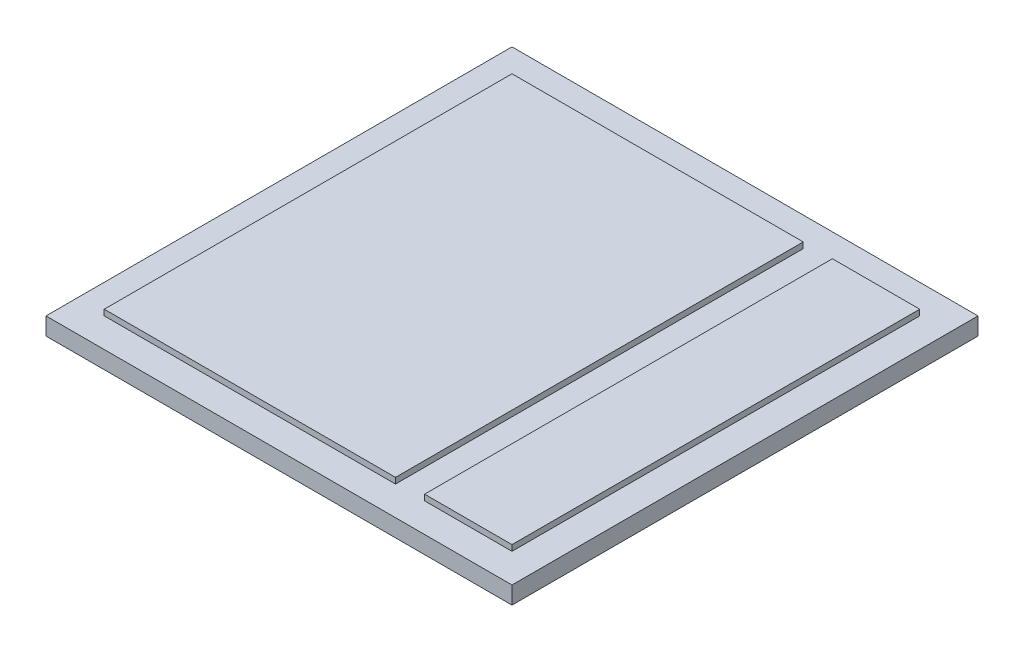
ISO-10303-21;
HEADER;
FILE_DESCRIPTION(('STEP AP214'),'2;1');
FILE_NAME('part.step','',(''),(''),'','','');
FILE_SCHEMA(('AUTOMOTIVE_DESIGN { 1 0 10303 214 1 1 1 1 }'));
ENDSEC;
DATA;
#1=APPLICATION_CONTEXT('core data for automotive mechanical design processes');
#2=APPLICATION_PROTOCOL_DEFINITION('international standard','automotive_design',2000,#1);
#3=PRODUCT_CONTEXT('',#1,'mechanical');
#4=PRODUCT('Part','Part','',(#3));
#5=PRODUCT_RELATED_PRODUCT_CATEGORY('part','',(#4));
#6=PRODUCT_DEFINITION_FORMATION('','',#4);
#7=PRODUCT_DEFINITION_CONTEXT('part definition',#1,'design');
#8=PRODUCT_DEFINITION('design','',#6,#7);
#9=PRODUCT_DEFINITION_SHAPE('','',#8);
#10=(LENGTH_UNIT() NAMED_UNIT(*) SI_UNIT(.MILLI.,.METRE.));
#11=(NAMED_UNIT(*) PLANE_ANGLE_UNIT() SI_UNIT($,.RADIAN.));
#12=(NAMED_UNIT(*) SI_UNIT($,.STERADIAN.) SOLID_ANGLE_UNIT());
#13=UNCERTAINTY_MEASURE_WITH_UNIT(LENGTH_MEASURE(1.E-05),#10,'distance_accuracy_value','');
#14=(GEOMETRIC_REPRESENTATION_CONTEXT(3) GLOBAL_UNCERTAINTY_ASSIGNED_CONTEXT((#13)) GLOBAL_UNIT_ASSIGNED_CONTEXT((#10,
#11,#12)) REPRESENTATION_CONTEXT('',''));
#15=CARTESIAN_POINT('',(0.,0.,0.));
#16=DIRECTION('',(0.,0.,1.));
#17=DIRECTION('',(1.,0.,0.));
#18=AXIS2_PLACEMENT_3D('',#15,#16,#17);
#19=CARTESIAN_POINT('',(0.,3.,0.));
#20=DIRECTION('',(0.,1.,0.));
#21=DIRECTION('',(0.,0.,1.));
#22=AXIS2_PLACEMENT_3D('',#19,#20,#21);
#23=PLANE('',#22);
#24=DIRECTION('',(0.,0.,-1.));
#25=VECTOR('',#24,1.);
#26=CARTESIAN_POINT('',(15.,3.,-35.));
#27=LINE('',#26,#25);
#28=CARTESIAN_POINT('',(15.,3.,35.));
#29=VERTEX_POINT('',#28);
#30=CARTESIAN_POINT('',(15.,3.,-35.));
#31=VERTEX_POINT('',#30);
#32=EDGE_CURVE('E62',#29,#31,#27,.T.);
#33=ORIENTED_EDGE('',*,*,#32,.F.);
#34=DIRECTION('',(1.,0.,0.));
#35=VECTOR('',#34,1.);
#36=CARTESIAN_POINT('',(-35.,3.,35.));
#37=LINE('',#36,#35);
#38=CARTESIAN_POINT('',(-35.,3.,35.));
#39=VERTEX_POINT('',#38);
#40=EDGE_CURVE('E165',#39,#29,#37,.T.);
#41=ORIENTED_EDGE('',*,*,#40,.F.);
#42=DIRECTION('',(0.,0.,1.));
#43=VECTOR('',#42,1.);
#44=CARTESIAN_POINT('',(-35.,3.,-35.));
#45=LINE('',#44,#43);
#46=CARTESIAN_POINT('',(-35.,3.,-35.));
#47=VERTEX_POINT('',#46);
#48=EDGE_CURVE('E174',#47,#39,#45,.T.);
#49=ORIENTED_EDGE('',*,*,#48,.F.);
#50=DIRECTION('',(-1.,0.,0.));
#51=VECTOR('',#50,1.);
#52=CARTESIAN_POINT('',(-35.,3.,-35.));
#53=LINE('',#52,#51);
#54=EDGE_CURVE('E150',#31,#47,#53,.T.);
#55=ORIENTED_EDGE('',*,*,#54,.F.);
#56=EDGE_LOOP('',(#33,#41,#49,#55));
#57=FACE_BOUND('',#56,.T.);
#58=DIRECTION('',(0.,0.,-1.));
#59=VECTOR('',#58,1.);
#60=CARTESIAN_POINT('',(40.,3.,-40.));
#61=LINE('',#60,#59);
#62=CARTESIAN_POINT('',(40.,3.,40.));
#63=VERTEX_POINT('',#62);
#64=CARTESIAN_POINT('',(40.,3.,-40.));
#65=VERTEX_POINT('',#64);
#66=EDGE_CURVE('E190',#63,#65,#61,.T.);
#67=ORIENTED_EDGE('',*,*,#66,.T.);
#68=DIRECTION('',(-1.,0.,0.));
#69=VECTOR('',#68,1.);
#70=CARTESIAN_POINT('',(-40.,3.,-40.));
#71=LINE('',#70,#69);
#72=CARTESIAN_POINT('',(-40.,3.,-40.));
#73=VERTEX_POINT('',#72);
#74=EDGE_CURVE('E193',#65,#73,#71,.T.);
#75=ORIENTED_EDGE('',*,*,#74,.T.);
#76=DIRECTION('',(0.,0.,1.));
#77=VECTOR('',#76,1.);
#78=CARTESIAN_POINT('',(-40.,3.,-40.));
#79=LINE('',#78,#77);
#80=CARTESIAN_POINT('',(-40.,3.,40.));
#81=VERTEX_POINT('',#80);
#82=EDGE_CURVE('E196',#73,#81,#79,.T.);
#83=ORIENTED_EDGE('',*,*,#82,.T.);
#84=DIRECTION('',(1.,0.,0.));
#85=VECTOR('',#84,1.);
#86=CARTESIAN_POINT('',(-40.,3.,40.));
#87=LINE('',#86,#85);
#88=EDGE_CURVE('E198',#81,#63,#87,.T.);
#89=ORIENTED_EDGE('',*,*,#88,.T.);
#90=EDGE_LOOP('',(#67,#75,#83,#89));
#91=FACE_BOUND('',#90,.T.);
#92=DIRECTION('',(-1.,0.,0.));
#93=VECTOR('',#92,1.);
#94=CARTESIAN_POINT('',(20.,3.,-35.));
#95=LINE('',#94,#93);
#96=CARTESIAN_POINT('',(35.,3.,-35.));
#97=VERTEX_POINT('',#96);
#98=CARTESIAN_POINT('',(20.,3.,-35.));
#99=VERTEX_POINT('',#98);
#100=EDGE_CURVE('E148',#97,#99,#95,.T.);
#101=ORIENTED_EDGE('',*,*,#100,.F.);
#102=DIRECTION('',(0.,0.,-1.));
#103=VECTOR('',#102,1.);
#104=CARTESIAN_POINT('',(35.,3.,-35.));
#105=LINE('',#104,#103);
#106=CARTESIAN_POINT('',(35.,3.,35.));
#107=VERTEX_POINT('',#106);
#108=EDGE_CURVE('E143',#107,#97,#105,.T.);
#109=ORIENTED_EDGE('',*,*,#108,.F.);
#110=DIRECTION('',(1.,0.,0.));
#111=VECTOR('',#110,1.);
#112=CARTESIAN_POINT('',(20.,3.,35.));
#113=LINE('',#112,#111);
#114=CARTESIAN_POINT('',(20.,3.,35.));
#115=VERTEX_POINT('',#114);
#116=EDGE_CURVE('E128',#115,#107,#113,.T.);
#117=ORIENTED_EDGE('',*,*,#116,.F.);
#118=DIRECTION('',(0.,0.,1.));
#119=VECTOR('',#118,1.);
#120=CARTESIAN_POINT('',(20.,3.,-35.));
#121=LINE('',#120,#119);
#122=EDGE_CURVE('E136',#99,#115,#121,.T.);
#123=ORIENTED_EDGE('',*,*,#122,.F.);
#124=EDGE_LOOP('',(#101,#109,#117,#123));
#125=FACE_BOUND('',#124,.T.);
#126=ADVANCED_FACE('F39',(#57,#91,#125),#23,.T.);
#127=CARTESIAN_POINT('',(40.,3.,-40.));
#128=DIRECTION('',(-1.,0.,0.));
#129=DIRECTION('',(0.,0.,1.));
#130=AXIS2_PLACEMENT_3D('',#127,#128,#129);
#131=PLANE('',#130);
#132=DIRECTION('',(0.,0.,-1.));
#133=VECTOR('',#132,1.);
#134=CARTESIAN_POINT('',(40.,0.,-40.));
#135=LINE('',#134,#133);
#136=CARTESIAN_POINT('',(40.,0.,40.));
#137=VERTEX_POINT('',#136);
#138=CARTESIAN_POINT('',(40.,0.,-40.));
#139=VERTEX_POINT('',#138);
#140=EDGE_CURVE('E189',#137,#139,#135,.T.);
#141=ORIENTED_EDGE('',*,*,#140,.T.);
#142=DIRECTION('',(0.,-1.,0.));
#143=VECTOR('',#142,1.);
#144=CARTESIAN_POINT('',(40.,3.,-40.));
#145=LINE('',#144,#143);
#146=EDGE_CURVE('E11',#65,#139,#145,.T.);
#147=ORIENTED_EDGE('',*,*,#146,.F.);
#148=ORIENTED_EDGE('',*,*,#66,.F.);
#149=DIRECTION('',(0.,-1.,0.));
#150=VECTOR('',#149,1.);
#151=CARTESIAN_POINT('',(40.,3.,40.));
#152=LINE('',#151,#150);
#153=EDGE_CURVE('E200',#63,#137,#152,.T.);
#154=ORIENTED_EDGE('',*,*,#153,.T.);
#155=EDGE_LOOP('',(#141,#147,#148,#154));
#156=FACE_BOUND('',#155,.T.);
#157=ADVANCED_FACE('F41',(#156),#131,.F.);
#158=CARTESIAN_POINT('',(-40.,3.,-40.));
#159=DIRECTION('',(0.,0.,1.));
#160=DIRECTION('',(1.,0.,0.));
#161=AXIS2_PLACEMENT_3D('',#158,#159,#160);
#162=PLANE('',#161);
#163=DIRECTION('',(-1.,0.,0.));
#164=VECTOR('',#163,1.);
#165=CARTESIAN_POINT('',(-40.,0.,-40.));
#166=LINE('',#165,#164);
#167=CARTESIAN_POINT('',(-40.,0.,-40.));
#168=VERTEX_POINT('',#167);
#169=EDGE_CURVE('E203',#139,#168,#166,.T.);
#170=ORIENTED_EDGE('',*,*,#169,.T.);
#171=DIRECTION('',(0.,-1.,0.));
#172=VECTOR('',#171,1.);
#173=CARTESIAN_POINT('',(-40.,3.,-40.));
#174=LINE('',#173,#172);
#175=EDGE_CURVE('E47',#73,#168,#174,.T.);
#176=ORIENTED_EDGE('',*,*,#175,.F.);
#177=ORIENTED_EDGE('',*,*,#74,.F.);
#178=ORIENTED_EDGE('',*,*,#146,.T.);
#179=EDGE_LOOP('',(#170,#176,#177,#178));
#180=FACE_BOUND('',#179,.T.);
#181=ADVANCED_FACE('F232',(#180),#162,.F.);
#182=CARTESIAN_POINT('',(-40.,3.,-40.));
#183=DIRECTION('',(1.,0.,0.));
#184=DIRECTION('',(0.,0.,-1.));
#185=AXIS2_PLACEMENT_3D('',#182,#183,#184);
#186=PLANE('',#185);
#187=DIRECTION('',(0.,0.,1.));
#188=VECTOR('',#187,1.);
#189=CARTESIAN_POINT('',(-40.,0.,-40.));
#190=LINE('',#189,#188);
#191=CARTESIAN_POINT('',(-40.,0.,40.));
#192=VERTEX_POINT('',#191);
#193=EDGE_CURVE('E205',#168,#192,#190,.T.);
#194=ORIENTED_EDGE('',*,*,#193,.T.);
#195=DIRECTION('',(0.,-1.,0.));
#196=VECTOR('',#195,1.);
#197=CARTESIAN_POINT('',(-40.,3.,40.));
#198=LINE('',#197,#196);
#199=EDGE_CURVE('E210',#81,#192,#198,.T.);
#200=ORIENTED_EDGE('',*,*,#199,.F.);
#201=ORIENTED_EDGE('',*,*,#82,.F.);
#202=ORIENTED_EDGE('',*,*,#175,.T.);
#203=EDGE_LOOP('',(#194,#200,#201,#202));
#204=FACE_BOUND('',#203,.T.);
#205=ADVANCED_FACE('F217',(#204),#186,.F.);
#206=CARTESIAN_POINT('',(-40.,3.,40.));
#207=DIRECTION('',(0.,0.,-1.));
#208=DIRECTION('',(-1.,0.,0.));
#209=AXIS2_PLACEMENT_3D('',#206,#207,#208);
#210=PLANE('',#209);
#211=DIRECTION('',(1.,0.,0.));
#212=VECTOR('',#211,1.);
#213=CARTESIAN_POINT('',(-40.,0.,40.));
#214=LINE('',#213,#212);
#215=EDGE_CURVE('E194',#192,#137,#214,.T.);
#216=ORIENTED_EDGE('',*,*,#215,.T.);
#217=ORIENTED_EDGE('',*,*,#153,.F.);
#218=ORIENTED_EDGE('',*,*,#88,.F.);
#219=ORIENTED_EDGE('',*,*,#199,.T.);
#220=EDGE_LOOP('',(#216,#217,#218,#219));
#221=FACE_BOUND('',#220,.T.);
#222=ADVANCED_FACE('F226',(#221),#210,.F.);
#223=CARTESIAN_POINT('',(0.,0.,0.));
#224=DIRECTION('',(0.,1.,0.));
#225=DIRECTION('',(0.,0.,1.));
#226=AXIS2_PLACEMENT_3D('',#223,#224,#225);
#227=PLANE('',#226);
#228=ORIENTED_EDGE('',*,*,#140,.F.);
#229=ORIENTED_EDGE('',*,*,#215,.F.);
#230=ORIENTED_EDGE('',*,*,#193,.F.);
#231=ORIENTED_EDGE('',*,*,#169,.F.);
#232=EDGE_LOOP('',(#228,#229,#230,#231));
#233=FACE_BOUND('',#232,.T.);
#234=ADVANCED_FACE('F223',(#233),#227,.F.);
#235=CARTESIAN_POINT('',(15.,4.,-35.));
#236=DIRECTION('',(-1.,0.,0.));
#237=DIRECTION('',(0.,0.,1.));
#238=AXIS2_PLACEMENT_3D('',#235,#236,#237);
#239=PLANE('',#238);
#240=ORIENTED_EDGE('',*,*,#32,.T.);
#241=DIRECTION('',(0.,-1.,0.));
#242=VECTOR('',#241,1.);
#243=CARTESIAN_POINT('',(15.,4.,-35.));
#244=LINE('',#243,#242);
#245=CARTESIAN_POINT('',(15.,4.,-35.));
#246=VERTEX_POINT('',#245);
#247=EDGE_CURVE('E186',#246,#31,#244,.T.);
#248=ORIENTED_EDGE('',*,*,#247,.F.);
#249=DIRECTION('',(0.,0.,-1.));
#250=VECTOR('',#249,1.);
#251=CARTESIAN_POINT('',(15.,4.,-35.));
#252=LINE('',#251,#250);
#253=CARTESIAN_POINT('',(15.,4.,35.));
#254=VERTEX_POINT('',#253);
#255=EDGE_CURVE('E161',#254,#246,#252,.T.);
#256=ORIENTED_EDGE('',*,*,#255,.F.);
#257=DIRECTION('',(0.,-1.,0.));
#258=VECTOR('',#257,1.);
#259=CARTESIAN_POINT('',(15.,4.,35.));
#260=LINE('',#259,#258);
#261=EDGE_CURVE('E170',#254,#29,#260,.T.);
#262=ORIENTED_EDGE('',*,*,#261,.T.);
#263=EDGE_LOOP('',(#240,#248,#256,#262));
#264=FACE_BOUND('',#263,.T.);
#265=ADVANCED_FACE('F245',(#264),#239,.F.);
#266=CARTESIAN_POINT('',(-35.,4.,-35.));
#267=DIRECTION('',(0.,0.,1.));
#268=DIRECTION('',(1.,0.,0.));
#269=AXIS2_PLACEMENT_3D('',#266,#267,#268);
#270=PLANE('',#269);
#271=ORIENTED_EDGE('',*,*,#54,.T.);
#272=DIRECTION('',(0.,-1.,0.));
#273=VECTOR('',#272,1.);
#274=CARTESIAN_POINT('',(-35.,4.,-35.));
#275=LINE('',#274,#273);
#276=CARTESIAN_POINT('',(-35.,4.,-35.));
#277=VERTEX_POINT('',#276);
#278=EDGE_CURVE('E183',#277,#47,#275,.T.);
#279=ORIENTED_EDGE('',*,*,#278,.F.);
#280=DIRECTION('',(-1.,0.,0.));
#281=VECTOR('',#280,1.);
#282=CARTESIAN_POINT('',(-35.,4.,-35.));
#283=LINE('',#282,#281);
#284=EDGE_CURVE('E164',#246,#277,#283,.T.);
#285=ORIENTED_EDGE('',*,*,#284,.F.);
#286=ORIENTED_EDGE('',*,*,#247,.T.);
#287=EDGE_LOOP('',(#271,#279,#285,#286));
#288=FACE_BOUND('',#287,.T.);
#289=ADVANCED_FACE('F264',(#288),#270,.F.);
#290=CARTESIAN_POINT('',(-35.,4.,-35.));
#291=DIRECTION('',(1.,0.,0.));
#292=DIRECTION('',(0.,0.,-1.));
#293=AXIS2_PLACEMENT_3D('',#290,#291,#292);
#294=PLANE('',#293);
#295=ORIENTED_EDGE('',*,*,#48,.T.);
#296=DIRECTION('',(0.,-1.,0.));
#297=VECTOR('',#296,1.);
#298=CARTESIAN_POINT('',(-35.,4.,35.));
#299=LINE('',#298,#297);
#300=CARTESIAN_POINT('',(-35.,4.,35.));
#301=VERTEX_POINT('',#300);
#302=EDGE_CURVE('E180',#301,#39,#299,.T.);
#303=ORIENTED_EDGE('',*,*,#302,.F.);
#304=DIRECTION('',(0.,0.,1.));
#305=VECTOR('',#304,1.);
#306=CARTESIAN_POINT('',(-35.,4.,-35.));
#307=LINE('',#306,#305);
#308=EDGE_CURVE('E167',#277,#301,#307,.T.);
#309=ORIENTED_EDGE('',*,*,#308,.F.);
#310=ORIENTED_EDGE('',*,*,#278,.T.);
#311=EDGE_LOOP('',(#295,#303,#309,#310));
#312=FACE_BOUND('',#311,.T.);
#313=ADVANCED_FACE('F271',(#312),#294,.F.);
#314=CARTESIAN_POINT('',(-35.,4.,35.));
#315=DIRECTION('',(0.,0.,-1.));
#316=DIRECTION('',(-1.,0.,0.));
#317=AXIS2_PLACEMENT_3D('',#314,#315,#316);
#318=PLANE('',#317);
#319=ORIENTED_EDGE('',*,*,#40,.T.);
#320=ORIENTED_EDGE('',*,*,#261,.F.);
#321=DIRECTION('',(1.,0.,0.));
#322=VECTOR('',#321,1.);
#323=CARTESIAN_POINT('',(-35.,4.,35.));
#324=LINE('',#323,#322);
#325=EDGE_CURVE('E169',#301,#254,#324,.T.);
#326=ORIENTED_EDGE('',*,*,#325,.F.);
#327=ORIENTED_EDGE('',*,*,#302,.T.);
#328=EDGE_LOOP('',(#319,#320,#326,#327));
#329=FACE_BOUND('',#328,.T.);
#330=ADVANCED_FACE('F278',(#329),#318,.F.);
#331=CARTESIAN_POINT('',(0.,4.,0.));
#332=DIRECTION('',(0.,1.,0.));
#333=DIRECTION('',(0.,0.,1.));
#334=AXIS2_PLACEMENT_3D('',#331,#332,#333);
#335=PLANE('',#334);
#336=ORIENTED_EDGE('',*,*,#255,.T.);
#337=ORIENTED_EDGE('',*,*,#284,.T.);
#338=ORIENTED_EDGE('',*,*,#308,.T.);
#339=ORIENTED_EDGE('',*,*,#325,.T.);
#340=EDGE_LOOP('',(#336,#337,#338,#339));
#341=FACE_BOUND('',#340,.T.);
#342=ADVANCED_FACE('F286',(#341),#335,.T.);
#343=CARTESIAN_POINT('',(35.,4.,-35.));
#344=DIRECTION('',(-1.,0.,0.));
#345=DIRECTION('',(0.,0.,1.));
#346=AXIS2_PLACEMENT_3D('',#343,#344,#345);
#347=PLANE('',#346);
#348=ORIENTED_EDGE('',*,*,#108,.T.);
#349=DIRECTION('',(0.,-1.,0.));
#350=VECTOR('',#349,1.);
#351=CARTESIAN_POINT('',(35.,4.,-35.));
#352=LINE('',#351,#350);
#353=CARTESIAN_POINT('',(35.,4.,-35.));
#354=VERTEX_POINT('',#353);
#355=EDGE_CURVE('E412',#354,#97,#352,.T.);
#356=ORIENTED_EDGE('',*,*,#355,.F.);
#357=DIRECTION('',(0.,0.,-1.));
#358=VECTOR('',#357,1.);
#359=CARTESIAN_POINT('',(35.,4.,-35.));
#360=LINE('',#359,#358);
#361=CARTESIAN_POINT('',(35.,4.,35.));
#362=VERTEX_POINT('',#361);
#363=EDGE_CURVE('E137',#362,#354,#360,.T.);
#364=ORIENTED_EDGE('',*,*,#363,.F.);
#365=DIRECTION('',(0.,-1.,0.));
#366=VECTOR('',#365,1.);
#367=CARTESIAN_POINT('',(35.,4.,35.));
#368=LINE('',#367,#366);
#369=EDGE_CURVE('E131',#362,#107,#368,.T.);
#370=ORIENTED_EDGE('',*,*,#369,.T.);
#371=EDGE_LOOP('',(#348,#356,#364,#370));
#372=FACE_BOUND('',#371,.T.);
#373=ADVANCED_FACE('F141',(#372),#347,.F.);
#374=CARTESIAN_POINT('',(20.,4.,-35.));
#375=DIRECTION('',(0.,0.,1.));
#376=DIRECTION('',(1.,0.,0.));
#377=AXIS2_PLACEMENT_3D('',#374,#375,#376);
#378=PLANE('',#377);
#379=ORIENTED_EDGE('',*,*,#100,.T.);
#380=DIRECTION('',(0.,-1.,0.));
#381=VECTOR('',#380,1.);
#382=CARTESIAN_POINT('',(20.,4.,-35.));
#383=LINE('',#382,#381);
#384=CARTESIAN_POINT('',(20.,4.,-35.));
#385=VERTEX_POINT('',#384);
#386=EDGE_CURVE('E413',#385,#99,#383,.T.);
#387=ORIENTED_EDGE('',*,*,#386,.F.);
#388=DIRECTION('',(-1.,0.,0.));
#389=VECTOR('',#388,1.);
#390=CARTESIAN_POINT('',(20.,4.,-35.));
#391=LINE('',#390,#389);
#392=EDGE_CURVE('E158',#354,#385,#391,.T.);
#393=ORIENTED_EDGE('',*,*,#392,.F.);
#394=ORIENTED_EDGE('',*,*,#355,.T.);
#395=EDGE_LOOP('',(#379,#387,#393,#394));
#396=FACE_BOUND('',#395,.T.);
#397=ADVANCED_FACE('F302',(#396),#378,.F.);
#398=CARTESIAN_POINT('',(20.,4.,-35.));
#399=DIRECTION('',(1.,0.,0.));
#400=DIRECTION('',(0.,0.,-1.));
#401=AXIS2_PLACEMENT_3D('',#398,#399,#400);
#402=PLANE('',#401);
#403=ORIENTED_EDGE('',*,*,#122,.T.);
#404=DIRECTION('',(0.,-1.,0.));
#405=VECTOR('',#404,1.);
#406=CARTESIAN_POINT('',(20.,4.,35.));
#407=LINE('',#406,#405);
#408=CARTESIAN_POINT('',(20.,4.,35.));
#409=VERTEX_POINT('',#408);
#410=EDGE_CURVE('E54',#409,#115,#407,.T.);
#411=ORIENTED_EDGE('',*,*,#410,.F.);
#412=DIRECTION('',(0.,0.,1.));
#413=VECTOR('',#412,1.);
#414=CARTESIAN_POINT('',(20.,4.,-35.));
#415=LINE('',#414,#413);
#416=EDGE_CURVE('E156',#385,#409,#415,.T.);
#417=ORIENTED_EDGE('',*,*,#416,.F.);
#418=ORIENTED_EDGE('',*,*,#386,.T.);
#419=EDGE_LOOP('',(#403,#411,#417,#418));
#420=FACE_BOUND('',#419,.T.);
#421=ADVANCED_FACE('F309',(#420),#402,.F.);
#422=CARTESIAN_POINT('',(20.,4.,35.));
#423=DIRECTION('',(0.,0.,-1.));
#424=DIRECTION('',(-1.,0.,0.));
#425=AXIS2_PLACEMENT_3D('',#422,#423,#424);
#426=PLANE('',#425);
#427=ORIENTED_EDGE('',*,*,#116,.T.);
#428=ORIENTED_EDGE('',*,*,#369,.F.);
#429=DIRECTION('',(1.,0.,0.));
#430=VECTOR('',#429,1.);
#431=CARTESIAN_POINT('',(20.,4.,35.));
#432=LINE('',#431,#430);
#433=EDGE_CURVE('E146',#409,#362,#432,.T.);
#434=ORIENTED_EDGE('',*,*,#433,.F.);
#435=ORIENTED_EDGE('',*,*,#410,.T.);
#436=EDGE_LOOP('',(#427,#428,#434,#435));
#437=FACE_BOUND('',#436,.T.);
#438=ADVANCED_FACE('F130',(#437),#426,.F.);
#439=CARTESIAN_POINT('',(0.,4.,0.));
#440=DIRECTION('',(0.,1.,0.));
#441=DIRECTION('',(0.,0.,1.));
#442=AXIS2_PLACEMENT_3D('',#439,#440,#441);
#443=PLANE('',#442);
#444=ORIENTED_EDGE('',*,*,#363,.T.);
#445=ORIENTED_EDGE('',*,*,#392,.T.);
#446=ORIENTED_EDGE('',*,*,#416,.T.);
#447=ORIENTED_EDGE('',*,*,#433,.T.);
#448=EDGE_LOOP('',(#444,#445,#446,#447));
#449=FACE_BOUND('',#448,.T.);
#450=ADVANCED_FACE('F324',(#449),#443,.T.);
#451=CLOSED_SHELL('',(#126,#157,#181,#205,#222,#234,#265,#289,#313,#330,#342,#373,#397,#421,
#438,#450));
#452=MANIFOLD_SOLID_BREP('B2',#451);
#453=ADVANCED_BREP_SHAPE_REPRESENTATION('',(#18,#452),#14);
#454=SHAPE_DEFINITION_REPRESENTATION(#9,#453);
ENDSEC;
END-ISO-10303-21;
